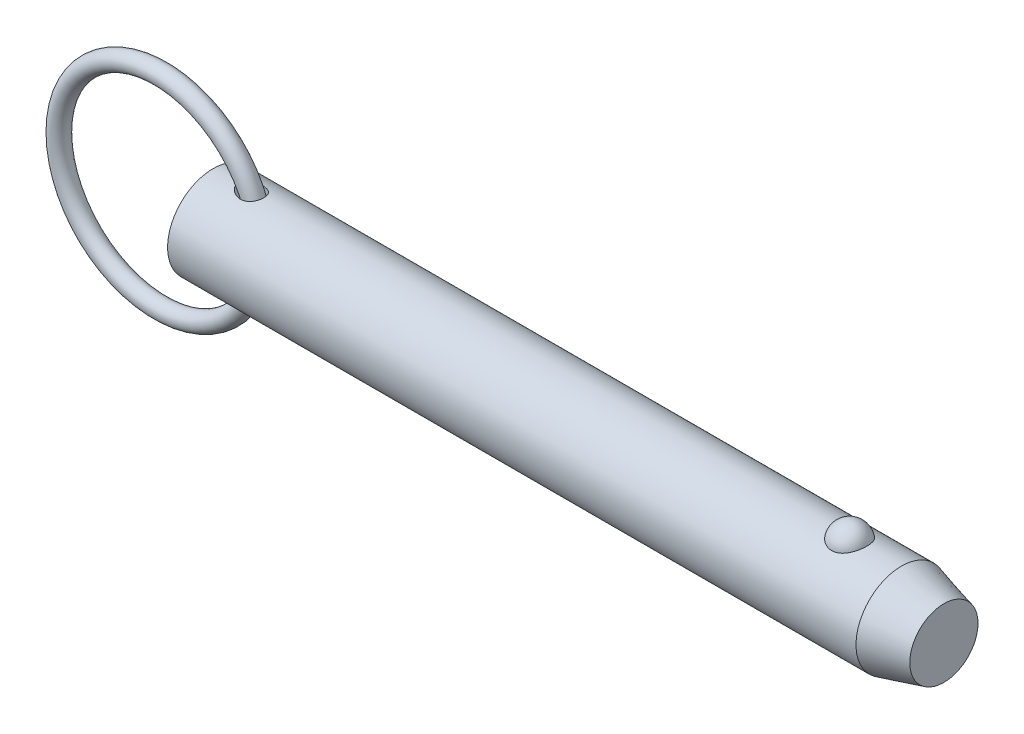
ISO-10303-21;
HEADER;
FILE_DESCRIPTION(('STEP AP214'),'2;1');
FILE_NAME('part.step','',(''),(''),'','','');
FILE_SCHEMA(('AUTOMOTIVE_DESIGN { 1 0 10303 214 1 1 1 1 }'));
ENDSEC;
DATA;
#1=APPLICATION_CONTEXT('core data for automotive mechanical design processes');
#2=APPLICATION_PROTOCOL_DEFINITION('international standard','automotive_design',2000,#1);
#3=PRODUCT_CONTEXT('',#1,'mechanical');
#4=PRODUCT('Part','Part','',(#3));
#5=PRODUCT_RELATED_PRODUCT_CATEGORY('part','',(#4));
#6=PRODUCT_DEFINITION_FORMATION('','',#4);
#7=PRODUCT_DEFINITION_CONTEXT('part definition',#1,'design');
#8=PRODUCT_DEFINITION('design','',#6,#7);
#9=PRODUCT_DEFINITION_SHAPE('','',#8);
#10=(LENGTH_UNIT() NAMED_UNIT(*) SI_UNIT(.MILLI.,.METRE.));
#11=(NAMED_UNIT(*) PLANE_ANGLE_UNIT() SI_UNIT($,.RADIAN.));
#12=(NAMED_UNIT(*) SI_UNIT($,.STERADIAN.) SOLID_ANGLE_UNIT());
#13=UNCERTAINTY_MEASURE_WITH_UNIT(LENGTH_MEASURE(1.E-05),#10,'distance_accuracy_value','');
#14=(GEOMETRIC_REPRESENTATION_CONTEXT(3) GLOBAL_UNCERTAINTY_ASSIGNED_CONTEXT((#13)) GLOBAL_UNIT_ASSIGNED_CONTEXT((#10,
#11,#12)) REPRESENTATION_CONTEXT('',''));
#15=CARTESIAN_POINT('',(0.,0.,0.));
#16=DIRECTION('',(0.,0.,1.));
#17=DIRECTION('',(1.,0.,0.));
#18=AXIS2_PLACEMENT_3D('',#15,#16,#17);
#19=CARTESIAN_POINT('',(-8.23730968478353,0.,0.));
#20=DIRECTION('',(0.,0.,1.));
#21=DIRECTION('',(1.,0.,0.));
#22=AXIS2_PLACEMENT_3D('',#19,#20,#21);
#23=TOROIDAL_SURFACE('',#22,15.875,1.422);
#24=CARTESIAN_POINT('',(9.05969031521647,0.,0.));
#25=VERTEX_POINT('',#24);
#26=VERTEX_LOOP('',#25);
#27=FACE_BOUND('',#26,.T.);
#28=ADVANCED_FACE('P0_F11',(#27),#23,.T.);
#29=CLOSED_SHELL('',(#28));
#30=MANIFOLD_SOLID_BREP('P0_B1',#29);
#31=CARTESIAN_POINT('',(0.,0.,0.));
#32=DIRECTION('',(1.,0.,0.));
#33=DIRECTION('',(0.,0.,-1.));
#34=AXIS2_PLACEMENT_3D('',#31,#32,#33);
#35=CYLINDRICAL_SURFACE('',#34,7.11);
#36=CARTESIAN_POINT('',(3.98467340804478,7.10072679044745,-0.363013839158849));
#37=CARTESIAN_POINT('',(4.00971652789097,7.09600153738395,-0.45539194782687));
#38=CARTESIAN_POINT('',(4.04401947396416,7.08958406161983,-0.545230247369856));
#39=CARTESIAN_POINT('',(4.12810160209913,7.07427055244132,-0.717157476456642));
#40=CARTESIAN_POINT('',(4.17791765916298,7.06536861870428,-0.799227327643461));
#41=CARTESIAN_POINT('',(4.28924471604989,7.04620300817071,-0.953469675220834));
#42=CARTESIAN_POINT('',(4.35063580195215,7.035953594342,-1.02573162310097));
#43=CARTESIAN_POINT('',(4.48282610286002,7.01493313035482,-1.16081412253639));
#44=CARTESIAN_POINT('',(4.55362244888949,7.00416223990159,-1.22363754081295));
#45=CARTESIAN_POINT('',(4.71659336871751,6.98090398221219,-1.35055080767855));
#46=CARTESIAN_POINT('',(4.81029272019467,6.96847103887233,-1.41269256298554));
#47=CARTESIAN_POINT('',(5.0057240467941,6.94515366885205,-1.52319699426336));
#48=CARTESIAN_POINT('',(5.10746392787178,6.93427079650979,-1.57154588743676));
#49=CARTESIAN_POINT('',(5.33503739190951,6.91346066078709,-1.66091325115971));
#50=CARTESIAN_POINT('',(5.46199550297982,6.90402388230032,-1.69921932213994));
#51=CARTESIAN_POINT('',(5.72084799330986,6.89024030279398,-1.75428261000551));
#52=CARTESIAN_POINT('',(5.85274301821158,6.88589416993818,-1.77103699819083));
#53=CARTESIAN_POINT('',(6.11557710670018,6.88337277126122,-1.78081990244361));
#54=CARTESIAN_POINT('',(6.24650031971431,6.88510489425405,-1.77420448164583));
#55=CARTESIAN_POINT('',(6.50446311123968,6.89478744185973,-1.73620392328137));
#56=CARTESIAN_POINT('',(6.6315075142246,6.90272978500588,-1.7048509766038));
#57=CARTESIAN_POINT('',(6.85933269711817,6.92243075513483,-1.62281888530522));
#58=CARTESIAN_POINT('',(6.96133251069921,6.93352131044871,-1.5753580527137));
#59=CARTESIAN_POINT('',(7.15436649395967,6.95824811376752,-1.46226310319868));
#60=CARTESIAN_POINT('',(7.24540699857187,6.97188287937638,-1.3966395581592));
#61=CARTESIAN_POINT('',(7.40446019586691,6.99838217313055,-1.25668991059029));
#62=CARTESIAN_POINT('',(7.473875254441,7.01118308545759,-1.18393777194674));
#63=CARTESIAN_POINT('',(7.59904891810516,7.03582803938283,-1.02736918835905));
#64=CARTESIAN_POINT('',(7.65481029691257,7.04767227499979,-0.943554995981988));
#65=CARTESIAN_POINT('',(7.74982438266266,7.06873077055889,-0.769795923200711));
#66=CARTESIAN_POINT('',(7.7894903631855,7.07800861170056,-0.680084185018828));
#67=CARTESIAN_POINT('',(7.85354088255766,7.09334756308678,-0.495102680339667));
#68=CARTESIAN_POINT('',(7.87792559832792,7.09940871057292,-0.399832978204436));
#69=CARTESIAN_POINT('',(7.9108898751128,7.10766731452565,-0.206294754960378));
#70=CARTESIAN_POINT('',(7.91944662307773,7.10985919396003,-0.108022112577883));
#71=CARTESIAN_POINT('',(7.920501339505,7.11012756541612,0.0886168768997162));
#72=CARTESIAN_POINT('',(7.91299895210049,7.10820396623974,0.186983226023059));
#73=CARTESIAN_POINT('',(7.88205794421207,7.10043733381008,0.381270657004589));
#74=CARTESIAN_POINT('',(7.85857985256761,7.09458459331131,0.477185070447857));
#75=CARTESIAN_POINT('',(7.79617406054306,7.07958431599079,0.663575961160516));
#76=CARTESIAN_POINT('',(7.75724672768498,7.07043685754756,0.754052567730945));
#77=CARTESIAN_POINT('',(7.66496731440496,7.04987259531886,0.926798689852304));
#78=CARTESIAN_POINT('',(7.61164530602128,7.0384605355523,1.00908483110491));
#79=CARTESIAN_POINT('',(7.49191707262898,7.01461776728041,1.16333092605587));
#80=CARTESIAN_POINT('',(7.42551210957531,7.00218715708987,1.235291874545));
#81=CARTESIAN_POINT('',(7.28164031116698,6.97770944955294,1.36680167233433));
#82=CARTESIAN_POINT('',(7.20420170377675,6.96566146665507,1.42638126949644));
#83=CARTESIAN_POINT('',(7.0403906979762,6.94319963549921,1.53199377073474));
#84=CARTESIAN_POINT('',(6.95401827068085,6.93278579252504,1.57802663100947));
#85=CARTESIAN_POINT('',(6.77318582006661,6.91444459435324,1.65656940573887));
#86=CARTESIAN_POINT('',(6.67860569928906,6.90656682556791,1.68881327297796));
#87=CARTESIAN_POINT('',(6.48544119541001,6.89422806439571,1.73849768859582));
#88=CARTESIAN_POINT('',(6.38685561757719,6.88976809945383,1.755933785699));
#89=CARTESIAN_POINT('',(6.18089829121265,6.88429907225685,1.77726234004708));
#90=CARTESIAN_POINT('',(6.07340937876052,6.88356485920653,1.78007646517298));
#91=CARTESIAN_POINT('',(5.85921220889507,6.886086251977,1.77029087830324));
#92=CARTESIAN_POINT('',(5.75250426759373,6.88934339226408,1.75768523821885));
#93=CARTESIAN_POINT('',(5.52848027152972,6.89994454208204,1.71563399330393));
#94=CARTESIAN_POINT('',(5.41155168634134,6.90775772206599,1.68424184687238));
#95=CARTESIAN_POINT('',(5.18376466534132,6.92670168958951,1.60454711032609));
#96=CARTESIAN_POINT('',(5.07291446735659,6.9378368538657,1.5562221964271));
#97=CARTESIAN_POINT('',(4.84835244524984,6.96347168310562,1.43744827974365));
#98=CARTESIAN_POINT('',(4.73562531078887,6.97820486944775,1.36517310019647));
#99=CARTESIAN_POINT('',(4.52504912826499,7.00822340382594,1.20158053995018));
#100=CARTESIAN_POINT('',(4.42717478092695,7.02350775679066,1.11029618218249));
#101=CARTESIAN_POINT('',(4.27935716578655,7.04784659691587,0.940654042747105));
#102=CARTESIAN_POINT('',(4.2239722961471,7.05736064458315,0.867099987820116));
#103=CARTESIAN_POINT('',(4.12558347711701,7.07469854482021,0.711919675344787));
#104=CARTESIAN_POINT('',(4.08256922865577,7.0825238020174,0.630300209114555));
#105=CARTESIAN_POINT('',(4.01142860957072,7.09565978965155,0.459428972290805));
#106=CARTESIAN_POINT('',(3.98346043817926,7.1009437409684,0.370107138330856));
#107=CARTESIAN_POINT('',(3.95517285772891,7.1063173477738,0.233358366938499));
#108=CARTESIAN_POINT('',(3.94802115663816,7.1076831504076,0.187321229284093));
#109=CARTESIAN_POINT('',(3.93842121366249,7.10951900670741,0.0947476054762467));
#110=CARTESIAN_POINT('',(3.93597129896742,7.10998937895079,0.0482113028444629));
#111=CARTESIAN_POINT('',(3.93584361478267,7.11001358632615,-0.0598597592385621));
#112=CARTESIAN_POINT('',(3.9399538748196,7.10922402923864,-0.12140511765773));
#113=CARTESIAN_POINT('',(3.95632793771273,7.10609781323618,-0.243320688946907));
#114=CARTESIAN_POINT('',(3.96859135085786,7.10376122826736,-0.303690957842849));
#115=CARTESIAN_POINT('',(3.98467340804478,7.10072679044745,-0.363013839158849));
#116=B_SPLINE_CURVE_WITH_KNOTS('',3,(#36,#37,#38,#39,#40,#41,#42,#43,#44,#45,#46,#47,#48,#49,
#50,#51,#52,#53,#54,#55,#56,#57,#58,#59,#60,#61,#62,#63,#64,#65,#66,#67,#68,#69,#70,#71,#72,#73,
#74,#75,#76,#77,#78,#79,#80,#81,#82,#83,#84,#85,#86,#87,#88,#89,#90,#91,#92,#93,#94,#95,#96,#97,
#98,#99,#100,#101,#102,#103,#104,#105,#106,#107,#108,#109,#110,#111,#112,#113,#114,#115),
.UNSPECIFIED.,.T.,.F.,(4,2,2,2,2,2,2,2,2,2,2,2,2,2,2,2,2,2,2,2,2,2,2,2,2,2,2,2,2,2,2,2,2,2,2,2,
2,2,2,4),(0.,0.287206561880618,0.575101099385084,0.860162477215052,1.14513709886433,
1.48324846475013,1.82169652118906,2.21865672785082,2.61566903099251,3.00665870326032,
3.39714041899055,3.73437585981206,4.07141541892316,4.37402271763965,4.67656849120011,
4.97076150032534,5.26495110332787,5.55956439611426,5.85418421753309,6.14953461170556,
6.44487798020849,6.73960905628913,7.03431171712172,7.32827352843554,7.6222362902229,
7.9216396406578,8.22113296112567,8.54242840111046,8.86384740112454,9.22635035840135,
9.58933304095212,9.99153142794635,10.3930368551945,10.6697219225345,10.9461759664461,
11.2254825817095,11.3650959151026,11.5046595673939,11.6891051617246,11.8735419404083),.UNSPECIFIED.);
#117=CARTESIAN_POINT('',(3.98467340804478,7.10072679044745,-0.363013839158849));
#118=VERTEX_POINT('',#117);
#119=EDGE_CURVE('P1_E40',#118,#118,#116,.T.);
#120=ORIENTED_EDGE('',*,*,#119,.T.);
#121=EDGE_LOOP('',(#120));
#122=FACE_BOUND('',#121,.T.);
#123=CARTESIAN_POINT('',(107.636279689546,0.,0.));
#124=DIRECTION('',(1.,0.,0.));
#125=DIRECTION('',(0.,0.,-1.));
#126=AXIS2_PLACEMENT_3D('',#123,#124,#125);
#127=CIRCLE('',#126,7.11);
#128=CARTESIAN_POINT('',(107.636279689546,0.,-7.11));
#129=VERTEX_POINT('',#128);
#130=EDGE_CURVE('P1_E25',#129,#129,#127,.T.);
#131=ORIENTED_EDGE('',*,*,#130,.F.);
#132=EDGE_LOOP('',(#131));
#133=FACE_BOUND('',#132,.T.);
#134=CARTESIAN_POINT('',(0.,0.,0.));
#135=DIRECTION('',(1.,0.,0.));
#136=DIRECTION('',(0.,0.,-1.));
#137=AXIS2_PLACEMENT_3D('',#134,#135,#136);
#138=CIRCLE('',#137,7.11);
#139=CARTESIAN_POINT('',(0.,0.,-7.11));
#140=VERTEX_POINT('',#139);
#141=EDGE_CURVE('P1_E9',#140,#140,#138,.T.);
#142=ORIENTED_EDGE('',*,*,#141,.T.);
#143=EDGE_LOOP('',(#142));
#144=FACE_BOUND('',#143,.T.);
#145=CARTESIAN_POINT('',(99.529258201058,6.53646663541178,2.79762469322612));
#146=CARTESIAN_POINT('',(99.3844296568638,6.53647876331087,2.79761243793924));
#147=CARTESIAN_POINT('',(99.239368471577,6.54144531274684,2.78608115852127));
#148=CARTESIAN_POINT('',(98.9532920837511,6.56077791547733,2.74023282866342));
#149=CARTESIAN_POINT('',(98.8122884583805,6.57516852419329,2.70585624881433));
#150=CARTESIAN_POINT('',(98.5388833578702,6.61165072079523,2.61544042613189));
#151=CARTESIAN_POINT('',(98.4064602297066,6.63372195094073,2.55945840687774));
#152=CARTESIAN_POINT('',(98.1532337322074,6.68316012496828,2.42742958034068));
#153=CARTESIAN_POINT('',(98.0324254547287,6.71052481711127,2.35139129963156));
#154=CARTESIAN_POINT('',(97.8016372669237,6.76860821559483,2.17866150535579));
#155=CARTESIAN_POINT('',(97.6920857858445,6.79940242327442,2.08142342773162));
#156=CARTESIAN_POINT('',(97.4903340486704,6.86050242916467,1.87020907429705));
#157=CARTESIAN_POINT('',(97.3981390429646,6.89080807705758,1.75622775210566));
#158=CARTESIAN_POINT('',(97.2292547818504,6.94923069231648,1.50900646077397));
#159=CARTESIAN_POINT('',(97.1534289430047,6.97719213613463,1.37513873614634));
#160=CARTESIAN_POINT('',(97.0242063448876,7.02647251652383,1.09584817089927));
#161=CARTESIAN_POINT('',(96.9708109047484,7.04779106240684,0.950424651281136));
#162=CARTESIAN_POINT('',(96.8871019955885,7.08180248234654,0.650508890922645));
#163=CARTESIAN_POINT('',(96.8570253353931,7.09440672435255,0.495940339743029));
#164=CARTESIAN_POINT('',(96.821473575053,7.10935121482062,0.183515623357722));
#165=CARTESIAN_POINT('',(96.8159974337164,7.11169189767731,0.0256595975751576));
#166=CARTESIAN_POINT('',(96.829700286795,7.10589702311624,-0.287512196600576));
#167=CARTESIAN_POINT('',(96.8486823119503,7.0978451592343,-0.442838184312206));
#168=CARTESIAN_POINT('',(96.9105745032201,7.07221860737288,-0.747830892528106));
#169=CARTESIAN_POINT('',(96.9534850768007,7.05464375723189,-0.897497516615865));
#170=CARTESIAN_POINT('',(97.0624527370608,7.01171031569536,-1.1872286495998));
#171=CARTESIAN_POINT('',(97.1285458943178,6.98633960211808,-1.32727778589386));
#172=CARTESIAN_POINT('',(97.2825362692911,6.93042258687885,-1.59370324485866));
#173=CARTESIAN_POINT('',(97.3704355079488,6.89987580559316,-1.72007829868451));
#174=CARTESIAN_POINT('',(97.5669269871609,6.83659510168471,-1.95657345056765));
#175=CARTESIAN_POINT('',(97.6756640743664,6.80384697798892,-2.0665695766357));
#176=CARTESIAN_POINT('',(97.9109686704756,6.7400183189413,-2.26611005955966));
#177=CARTESIAN_POINT('',(98.0375350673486,6.70893767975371,-2.35565569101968));
#178=CARTESIAN_POINT('',(98.3028454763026,6.65264442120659,-2.51019726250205));
#179=CARTESIAN_POINT('',(98.4413230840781,6.62733449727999,-2.5756139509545));
#180=CARTESIAN_POINT('',(98.7285194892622,6.58495995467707,-2.68211134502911));
#181=CARTESIAN_POINT('',(98.8772343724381,6.56789220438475,-2.72320129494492));
#182=CARTESIAN_POINT('',(99.1726268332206,6.54478663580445,-2.77825810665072));
#183=CARTESIAN_POINT('',(99.3190295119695,6.53823639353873,-2.7934872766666));
#184=CARTESIAN_POINT('',(99.6124700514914,6.5353271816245,-2.80028921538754));
#185=CARTESIAN_POINT('',(99.7595077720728,6.53896606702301,-2.79186696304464));
#186=CARTESIAN_POINT('',(100.044921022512,6.55570357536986,-2.75232178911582));
#187=CARTESIAN_POINT('',(100.183422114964,6.56848455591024,-2.72196077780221));
#188=CARTESIAN_POINT('',(100.453114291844,6.60173528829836,-2.64028774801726));
#189=CARTESIAN_POINT('',(100.584304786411,6.62220565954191,-2.58897404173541));
#190=CARTESIAN_POINT('',(100.838846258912,6.6691792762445,-2.46547820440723));
#191=CARTESIAN_POINT('',(100.961969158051,6.69580233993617,-2.39287266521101));
#192=CARTESIAN_POINT('',(101.194441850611,6.75207041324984,-2.22915269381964));
#193=CARTESIAN_POINT('',(101.303788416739,6.78171612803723,-2.13803393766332));
#194=CARTESIAN_POINT('',(101.511642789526,6.8426462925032,-1.93445592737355));
#195=CARTESIAN_POINT('',(101.609317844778,6.87393748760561,-1.82114774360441));
#196=CARTESIAN_POINT('',(101.785011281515,6.93345710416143,-1.5794778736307));
#197=CARTESIAN_POINT('',(101.863026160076,6.96168497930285,-1.45111351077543));
#198=CARTESIAN_POINT('',(101.999985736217,7.01307558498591,-1.17842708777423));
#199=CARTESIAN_POINT('',(102.058258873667,7.03605262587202,-1.03373189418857));
#200=CARTESIAN_POINT('',(102.151081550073,7.07340932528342,-0.735867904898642));
#201=CARTESIAN_POINT('',(102.185631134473,7.08778900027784,-0.582699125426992));
#202=CARTESIAN_POINT('',(102.230274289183,7.10647639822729,-0.272420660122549));
#203=CARTESIAN_POINT('',(102.24039710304,7.11079616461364,-0.115315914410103));
#204=CARTESIAN_POINT('',(102.236061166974,7.10896059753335,0.198488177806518));
#205=CARTESIAN_POINT('',(102.221603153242,7.10280557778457,0.355187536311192));
#206=CARTESIAN_POINT('',(102.168572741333,7.08071500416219,0.662724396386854));
#207=CARTESIAN_POINT('',(102.13015058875,7.06484039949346,0.813592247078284));
#208=CARTESIAN_POINT('',(102.030101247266,7.0249589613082,1.10629159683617));
#209=CARTESIAN_POINT('',(101.968472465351,7.00095156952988,1.24812247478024));
#210=CARTESIAN_POINT('',(101.822766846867,6.94706632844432,1.51976439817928));
#211=CARTESIAN_POINT('',(101.738544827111,6.91715085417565,1.64949012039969));
#212=CARTESIAN_POINT('',(101.549586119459,6.85470565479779,1.89231285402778));
#213=CARTESIAN_POINT('',(101.444850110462,6.82217601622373,2.0054104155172));
#214=CARTESIAN_POINT('',(101.217103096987,6.75805358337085,2.21190674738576));
#215=CARTESIAN_POINT('',(101.094082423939,6.72646129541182,2.30529503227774));
#216=CARTESIAN_POINT('',(100.83273470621,6.66789520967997,2.4695990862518));
#217=CARTESIAN_POINT('',(100.694401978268,6.64092313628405,2.5405064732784));
#218=CARTESIAN_POINT('',(100.411182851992,6.59572583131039,2.65560045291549));
#219=CARTESIAN_POINT('',(100.266666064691,6.57724013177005,2.7005953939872));
#220=CARTESIAN_POINT('',(99.9715469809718,6.55006426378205,2.76587321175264));
#221=CARTESIAN_POINT('',(99.8209640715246,6.54134511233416,2.78622922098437));
#222=CARTESIAN_POINT('',(99.6230463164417,6.53697847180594,2.79642434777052));
#223=CARTESIAN_POINT('',(99.5761644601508,6.53646270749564,2.79762866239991));
#224=CARTESIAN_POINT('',(99.529258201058,6.53646663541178,2.79762469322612));
#225=B_SPLINE_CURVE_WITH_KNOTS('',3,(#145,#146,#147,#148,#149,#150,#151,#152,#153,#154,#155,
#156,#157,#158,#159,#160,#161,#162,#163,#164,#165,#166,#167,#168,#169,#170,#171,#172,#173,#174,
#175,#176,#177,#178,#179,#180,#181,#182,#183,#184,#185,#186,#187,#188,#189,#190,#191,#192,#193,
#194,#195,#196,#197,#198,#199,#200,#201,#202,#203,#204,#205,#206,#207,#208,#209,#210,#211,#212,
#213,#214,#215,#216,#217,#218,#219,#220,#221,#222,#223,#224),.UNSPECIFIED.,.T.,.F.,(4,2,2,2,2,2,
2,2,2,2,2,2,2,2,2,2,2,2,2,2,2,2,2,2,2,2,2,2,2,2,2,2,2,2,2,2,2,2,2,4),(0.,0.434355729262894,
0.86984774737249,1.30419416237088,1.73835621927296,2.18541922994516,2.6326172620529,
3.09954261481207,3.56649542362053,4.03813031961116,4.50974525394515,4.97758575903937,
5.4454342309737,5.91401389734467,6.38263700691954,6.85464418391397,7.32662193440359,
7.78992971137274,8.25306131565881,8.69285754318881,9.13256119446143,9.5576862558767,
9.98284556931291,10.4171106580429,10.851477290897,11.3079089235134,11.7644218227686,
12.2351898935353,12.7059570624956,13.1761603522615,13.6463495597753,14.1136200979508,
14.5809227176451,15.0513032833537,15.5216682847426,15.9922828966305,16.4630727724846,
16.9182457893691,17.3720644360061,17.5127411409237),.UNSPECIFIED.);
#226=CARTESIAN_POINT('',(99.529258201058,6.53646663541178,2.79762469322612));
#227=VERTEX_POINT('',#226);
#228=EDGE_CURVE('P1_E34',#227,#227,#225,.T.);
#229=ORIENTED_EDGE('',*,*,#228,.T.);
#230=EDGE_LOOP('',(#229));
#231=FACE_BOUND('',#230,.T.);
#232=CARTESIAN_POINT('',(3.98467340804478,-7.10072679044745,-0.363013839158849));
#233=CARTESIAN_POINT('',(3.96426456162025,-7.10457733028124,-0.28771410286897));
#234=CARTESIAN_POINT('',(3.95000501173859,-7.10730349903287,-0.210695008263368));
#235=CARTESIAN_POINT('',(3.93481801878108,-7.11020840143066,-0.0553038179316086));
#236=CARTESIAN_POINT('',(3.93388435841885,-7.11038832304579,0.0230676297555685));
#237=CARTESIAN_POINT('',(3.94541910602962,-7.10817995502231,0.178714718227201));
#238=CARTESIAN_POINT('',(3.95787987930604,-7.10579312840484,0.25599095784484));
#239=CARTESIAN_POINT('',(3.99523775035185,-7.09872642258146,0.407352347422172));
#240=CARTESIAN_POINT('',(4.02014065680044,-7.09404547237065,0.481435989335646));
#241=CARTESIAN_POINT('',(4.08119600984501,-7.08278363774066,0.625775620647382));
#242=CARTESIAN_POINT('',(4.11749458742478,-7.07617815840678,0.695967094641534));
#243=CARTESIAN_POINT('',(4.19940836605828,-7.06165305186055,0.830508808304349));
#244=CARTESIAN_POINT('',(4.24502952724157,-7.0537325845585,0.894855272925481));
#245=CARTESIAN_POINT('',(4.36790232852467,-7.03310314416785,1.04688574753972));
#246=CARTESIAN_POINT('',(4.44977459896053,-7.01993229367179,1.13078695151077));
#247=CARTESIAN_POINT('',(4.62610796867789,-6.99351259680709,1.28411726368));
#248=CARTESIAN_POINT('',(4.7205898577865,-6.98026365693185,1.35352197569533));
#249=CARTESIAN_POINT('',(4.92036507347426,-6.9549104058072,1.47831921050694));
#250=CARTESIAN_POINT('',(5.02579054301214,-6.94282458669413,1.53350332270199));
#251=CARTESIAN_POINT('',(5.24378330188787,-6.92129098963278,1.62793610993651));
#252=CARTESIAN_POINT('',(5.35635066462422,-6.91184323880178,1.66718462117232));
#253=CARTESIAN_POINT('',(5.60134354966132,-6.89573491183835,1.73269893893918));
#254=CARTESIAN_POINT('',(5.73444697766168,-6.8895970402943,1.75661057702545));
#255=CARTESIAN_POINT('',(6.00300738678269,-6.88344616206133,1.78057487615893));
#256=CARTESIAN_POINT('',(6.13846360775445,-6.88343121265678,1.78063510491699));
#257=CARTESIAN_POINT('',(6.39660470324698,-6.88981379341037,1.75576480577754));
#258=CARTESIAN_POINT('',(6.51947843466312,-6.89572457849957,1.73273121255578));
#259=CARTESIAN_POINT('',(6.75813770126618,-6.91274434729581,1.66352936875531));
#260=CARTESIAN_POINT('',(6.87393155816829,-6.92384709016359,1.61738888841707));
#261=CARTESIAN_POINT('',(7.07801861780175,-6.94787316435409,1.51052664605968));
#262=CARTESIAN_POINT('',(7.16789841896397,-6.96033024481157,1.45271574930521));
#263=CARTESIAN_POINT('',(7.33546773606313,-6.98638661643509,1.32171912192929));
#264=CARTESIAN_POINT('',(7.41316182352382,-6.99998547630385,1.24853918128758));
#265=CARTESIAN_POINT('',(7.54861420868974,-7.02559503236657,1.09486170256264));
#266=CARTESIAN_POINT('',(7.60741145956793,-7.03764930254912,1.01528346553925));
#267=CARTESIAN_POINT('',(7.71070740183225,-7.0598657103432,0.847099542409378));
#268=CARTESIAN_POINT('',(7.75520788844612,-7.0700280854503,0.758494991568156));
#269=CARTESIAN_POINT('',(7.82836147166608,-7.08722075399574,0.575936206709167));
#270=CARTESIAN_POINT('',(7.85719783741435,-7.09428707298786,0.482058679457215));
#271=CARTESIAN_POINT('',(7.89918378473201,-7.10470260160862,0.290658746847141));
#272=CARTESIAN_POINT('',(7.91233308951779,-7.10805174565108,0.193136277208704));
#273=CARTESIAN_POINT('',(7.92267451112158,-7.11067890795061,-0.00313968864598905));
#274=CARTESIAN_POINT('',(7.91981203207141,-7.10994299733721,-0.101896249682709));
#275=CARTESIAN_POINT('',(7.89806489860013,-7.10444651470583,-0.297516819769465));
#276=CARTESIAN_POINT('',(7.87918005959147,-7.09968589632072,-0.394380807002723));
#277=CARTESIAN_POINT('',(7.82577988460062,-7.0866471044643,-0.583553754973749));
#278=CARTESIAN_POINT('',(7.79124976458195,-7.07836560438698,-0.675858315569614));
#279=CARTESIAN_POINT('',(7.70736343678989,-7.05919003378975,-0.853167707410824));
#280=CARTESIAN_POINT('',(7.65800801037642,-7.04829610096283,-0.938172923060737));
#281=CARTESIAN_POINT('',(7.54590141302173,-7.02513961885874,-1.09819812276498));
#282=CARTESIAN_POINT('',(7.48319521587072,-7.01288172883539,-1.17325029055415));
#283=CARTESIAN_POINT('',(7.34599775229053,-6.98832192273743,-1.31164333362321));
#284=CARTESIAN_POINT('',(7.27150757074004,-6.97602001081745,-1.37498528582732));
#285=CARTESIAN_POINT('',(7.11277776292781,-6.95268608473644,-1.48849974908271));
#286=CARTESIAN_POINT('',(7.02852525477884,-6.94165578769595,-1.53865456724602));
#287=CARTESIAN_POINT('',(6.85282430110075,-6.92200320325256,-1.62478650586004));
#288=CARTESIAN_POINT('',(6.76137511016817,-6.91338116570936,-1.66076215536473));
#289=CARTESIAN_POINT('',(6.57061179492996,-6.89906044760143,-1.71930563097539));
#290=CARTESIAN_POINT('',(6.4711351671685,-6.89347290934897,-1.74136795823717));
#291=CARTESIAN_POINT('',(6.26989833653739,-6.88605020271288,-1.7704895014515));
#292=CARTESIAN_POINT('',(6.16813737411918,-6.88421630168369,-1.77754365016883));
#293=CARTESIAN_POINT('',(5.95492537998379,-6.88424071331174,-1.77745174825));
#294=CARTESIAN_POINT('',(5.8434768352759,-6.88646827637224,-1.76888555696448));
#295=CARTESIAN_POINT('',(5.62307560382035,-6.89483827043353,-1.73596677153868));
#296=CARTESIAN_POINT('',(5.51412477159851,-6.90098351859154,-1.71160281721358));
#297=CARTESIAN_POINT('',(5.28644478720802,-6.91743803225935,-1.64393691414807));
#298=CARTESIAN_POINT('',(5.16837217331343,-6.92819628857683,-1.59852806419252));
#299=CARTESIAN_POINT('',(4.94091825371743,-6.95234836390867,-1.4899796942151));
#300=CARTESIAN_POINT('',(4.83153887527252,-6.96574276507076,-1.42683625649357));
#301=CARTESIAN_POINT('',(4.63576710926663,-6.99209234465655,-1.29112257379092));
#302=CARTESIAN_POINT('',(4.54816728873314,-7.00494184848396,-1.22027748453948));
#303=CARTESIAN_POINT('',(4.3855489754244,-7.03019055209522,-1.0652111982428));
#304=CARTESIAN_POINT('',(4.31052141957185,-7.04259007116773,-0.980999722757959));
#305=CARTESIAN_POINT('',(4.18551811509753,-7.0640229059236,-0.811206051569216));
#306=CARTESIAN_POINT('',(4.13358417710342,-7.07328321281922,-0.727107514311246));
#307=CARTESIAN_POINT('',(4.04607461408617,-7.0891994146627,-0.550580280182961));
#308=CARTESIAN_POINT('',(4.01046401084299,-7.09586087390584,-0.458169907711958));
#309=CARTESIAN_POINT('',(3.98467340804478,-7.10072679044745,-0.363013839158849));
#310=B_SPLINE_CURVE_WITH_KNOTS('',3,(#232,#233,#234,#235,#236,#237,#238,#239,#240,#241,#242,
#243,#244,#245,#246,#247,#248,#249,#250,#251,#252,#253,#254,#255,#256,#257,#258,#259,#260,#261,
#262,#263,#264,#265,#266,#267,#268,#269,#270,#271,#272,#273,#274,#275,#276,#277,#278,#279,#280,
#281,#282,#283,#284,#285,#286,#287,#288,#289,#290,#291,#292,#293,#294,#295,#296,#297,#298,#299,
#300,#301,#302,#303,#304,#305,#306,#307,#308,#309),.UNSPECIFIED.,.T.,.F.,(4,2,2,2,2,2,2,2,2,2,2,
2,2,2,2,2,2,2,2,2,2,2,2,2,2,2,2,2,2,2,2,2,2,2,2,2,2,2,4),(0.,0.23402065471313,0.467932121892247,
0.701710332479,0.935597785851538,1.17261620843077,1.40978663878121,1.76177576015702,
2.11435255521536,2.47183528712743,2.8293216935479,3.23332937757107,3.63720887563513,
4.01042610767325,4.38319587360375,4.70425151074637,5.02518641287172,5.32277979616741,
5.62033579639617,5.91433101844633,6.2083314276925,6.50333490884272,6.79834178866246,
7.09362801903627,7.38889868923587,7.6831900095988,7.9774542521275,8.27211131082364,
8.566798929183,8.8716552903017,9.17661456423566,9.51069129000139,9.84500851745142,
10.2243046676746,10.6036846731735,10.9425776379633,11.2812252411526,11.5775945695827,
11.8733258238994),.UNSPECIFIED.);
#311=CARTESIAN_POINT('',(3.98467340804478,-7.10072679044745,-0.363013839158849));
#312=VERTEX_POINT('',#311);
#313=EDGE_CURVE('P1_E17',#312,#312,#310,.T.);
#314=ORIENTED_EDGE('',*,*,#313,.T.);
#315=EDGE_LOOP('',(#314));
#316=FACE_BOUND('',#315,.T.);
#317=ADVANCED_FACE('P1_F13',(#122,#133,#144,#231,#316),#35,.T.);
#318=CARTESIAN_POINT('',(0.,0.,0.));
#319=DIRECTION('',(-1.,0.,0.));
#320=DIRECTION('',(0.,0.,1.));
#321=AXIS2_PLACEMENT_3D('',#318,#319,#320);
#322=PLANE('',#321);
#323=ORIENTED_EDGE('',*,*,#141,.F.);
#324=EDGE_LOOP('',(#323));
#325=FACE_BOUND('',#324,.T.);
#326=ADVANCED_FACE('P1_F15',(#325),#322,.T.);
#327=CARTESIAN_POINT('',(114.27,0.,0.));
#328=DIRECTION('',(-1.,0.,0.));
#329=DIRECTION('',(0.,0.,1.));
#330=AXIS2_PLACEMENT_3D('',#327,#328,#329);
#331=CONICAL_SURFACE('',#330,5.33250000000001,0.26179938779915);
#332=ORIENTED_EDGE('',*,*,#130,.T.);
#333=EDGE_LOOP('',(#332));
#334=FACE_BOUND('',#333,.T.);
#335=CARTESIAN_POINT('',(114.27,0.,0.));
#336=DIRECTION('',(1.,0.,0.));
#337=DIRECTION('',(0.,0.,-1.));
#338=AXIS2_PLACEMENT_3D('',#335,#336,#337);
#339=CIRCLE('',#338,5.33250000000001);
#340=CARTESIAN_POINT('',(114.27,0.,-5.33250000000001));
#341=VERTEX_POINT('',#340);
#342=EDGE_CURVE('P1_E30',#341,#341,#339,.T.);
#343=ORIENTED_EDGE('',*,*,#342,.F.);
#344=EDGE_LOOP('',(#343));
#345=FACE_BOUND('',#344,.T.);
#346=ADVANCED_FACE('P1_F55',(#334,#345),#331,.T.);
#347=CARTESIAN_POINT('',(114.27,5.33250000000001,0.));
#348=DIRECTION('',(1.,0.,0.));
#349=DIRECTION('',(0.,0.,-1.));
#350=AXIS2_PLACEMENT_3D('',#347,#348,#349);
#351=PLANE('',#350);
#352=ORIENTED_EDGE('',*,*,#342,.T.);
#353=EDGE_LOOP('',(#352));
#354=FACE_BOUND('',#353,.T.);
#355=ADVANCED_FACE('P1_F51',(#354),#351,.T.);
#356=CARTESIAN_POINT('',(99.529258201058,6.39899999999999,0.));
#357=DIRECTION('',(-1.,0.,0.));
#358=DIRECTION('',(0.,1.,0.));
#359=AXIS2_PLACEMENT_3D('',#356,#357,#358);
#360=SPHERICAL_SURFACE('',#359,2.801);
#361=ORIENTED_EDGE('',*,*,#228,.F.);
#362=EDGE_LOOP('',(#361));
#363=FACE_BOUND('',#362,.T.);
#364=ADVANCED_FACE('P1_F46',(#363),#360,.T.);
#365=CARTESIAN_POINT('',(-8.23730968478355,0.,0.));
#366=DIRECTION('',(0.,0.,1.));
#367=DIRECTION('',(1.,0.,0.));
#368=AXIS2_PLACEMENT_3D('',#365,#366,#367);
#369=TOROIDAL_SURFACE('',#368,15.875,1.7775);
#370=ORIENTED_EDGE('',*,*,#313,.F.);
#371=EDGE_LOOP('',(#370));
#372=FACE_BOUND('',#371,.T.);
#373=ORIENTED_EDGE('',*,*,#119,.F.);
#374=EDGE_LOOP('',(#373));
#375=FACE_BOUND('',#374,.T.);
#376=ADVANCED_FACE('P1_F50',(#372,#375),#369,.F.);
#377=CLOSED_SHELL('',(#317,#326,#346,#355,#364,#376));
#378=MANIFOLD_SOLID_BREP('P1_B1',#377);
#379=ADVANCED_BREP_SHAPE_REPRESENTATION('',(#18,#30,#378),#14);
#380=SHAPE_DEFINITION_REPRESENTATION(#9,#379);
ENDSEC;
END-ISO-10303-21;
